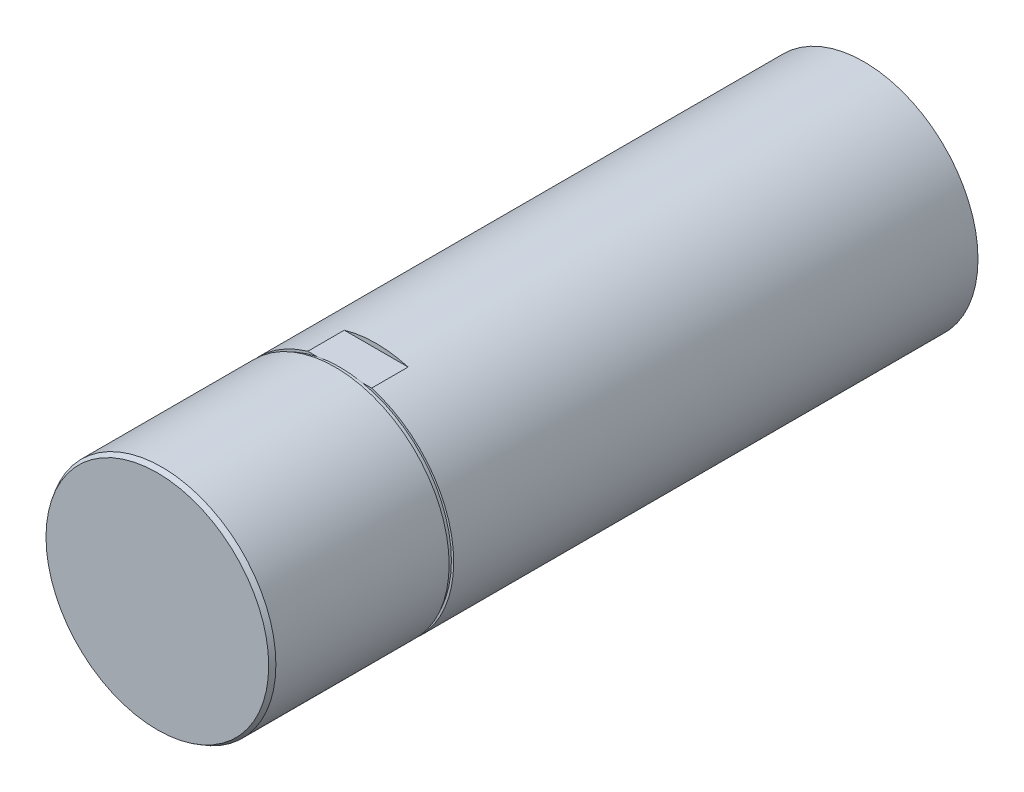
ISO-10303-21;
HEADER;
FILE_DESCRIPTION(('STEP AP214'),'2;1');
FILE_NAME('part.step','',(''),(''),'','','');
FILE_SCHEMA(('AUTOMOTIVE_DESIGN { 1 0 10303 214 1 1 1 1 }'));
ENDSEC;
DATA;
#1=APPLICATION_CONTEXT('core data for automotive mechanical design processes');
#2=APPLICATION_PROTOCOL_DEFINITION('international standard','automotive_design',2000,#1);
#3=PRODUCT_CONTEXT('',#1,'mechanical');
#4=PRODUCT('Part','Part','',(#3));
#5=PRODUCT_RELATED_PRODUCT_CATEGORY('part','',(#4));
#6=PRODUCT_DEFINITION_FORMATION('','',#4);
#7=PRODUCT_DEFINITION_CONTEXT('part definition',#1,'design');
#8=PRODUCT_DEFINITION('design','',#6,#7);
#9=PRODUCT_DEFINITION_SHAPE('','',#8);
#10=(LENGTH_UNIT() NAMED_UNIT(*) SI_UNIT(.MILLI.,.METRE.));
#11=(NAMED_UNIT(*) PLANE_ANGLE_UNIT() SI_UNIT($,.RADIAN.));
#12=(NAMED_UNIT(*) SI_UNIT($,.STERADIAN.) SOLID_ANGLE_UNIT());
#13=UNCERTAINTY_MEASURE_WITH_UNIT(LENGTH_MEASURE(1.E-05),#10,'distance_accuracy_value','');
#14=(GEOMETRIC_REPRESENTATION_CONTEXT(3) GLOBAL_UNCERTAINTY_ASSIGNED_CONTEXT((#13)) GLOBAL_UNIT_ASSIGNED_CONTEXT((#10,
#11,#12)) REPRESENTATION_CONTEXT('',''));
#15=CARTESIAN_POINT('',(0.,0.,0.));
#16=DIRECTION('',(0.,0.,1.));
#17=DIRECTION('',(1.,0.,0.));
#18=AXIS2_PLACEMENT_3D('',#15,#16,#17);
#19=CARTESIAN_POINT('',(0.,0.,15.));
#20=DIRECTION('',(0.,0.,1.));
#21=DIRECTION('',(1.,0.,0.));
#22=AXIS2_PLACEMENT_3D('',#19,#20,#21);
#23=PLANE('',#22);
#24=DIRECTION('',(1.,0.,0.));
#25=VECTOR('',#24,1.);
#26=CARTESIAN_POINT('',(-10.5,-24.,15.));
#27=LINE('',#26,#25);
#28=CARTESIAN_POINT('',(4.92442890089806,-24.,15.));
#29=VERTEX_POINT('',#28);
#30=CARTESIAN_POINT('',(7.00000000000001,-24.,15.));
#31=VERTEX_POINT('',#30);
#32=EDGE_CURVE('E98',#29,#31,#27,.T.);
#33=ORIENTED_EDGE('',*,*,#32,.T.);
#34=CARTESIAN_POINT('',(0.,0.,15.));
#35=DIRECTION('',(0.,0.,1.));
#36=DIRECTION('',(1.,0.,0.));
#37=AXIS2_PLACEMENT_3D('',#34,#35,#36);
#38=CIRCLE('',#37,25.);
#39=CARTESIAN_POINT('',(7.00000000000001,24.,15.));
#40=VERTEX_POINT('',#39);
#41=EDGE_CURVE('E112',#31,#40,#38,.T.);
#42=ORIENTED_EDGE('',*,*,#41,.T.);
#43=DIRECTION('',(1.,0.,0.));
#44=VECTOR('',#43,1.);
#45=CARTESIAN_POINT('',(-10.5,24.,15.));
#46=LINE('',#45,#44);
#47=CARTESIAN_POINT('',(4.92442890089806,24.,15.));
#48=VERTEX_POINT('',#47);
#49=EDGE_CURVE('E146',#48,#40,#46,.T.);
#50=ORIENTED_EDGE('',*,*,#49,.F.);
#51=CARTESIAN_POINT('',(0.,0.,15.));
#52=DIRECTION('',(0.,0.,1.));
#53=DIRECTION('',(1.,0.,0.));
#54=AXIS2_PLACEMENT_3D('',#51,#52,#53);
#55=CIRCLE('',#54,24.5);
#56=EDGE_CURVE('E140',#29,#48,#55,.T.);
#57=ORIENTED_EDGE('',*,*,#56,.F.);
#58=EDGE_LOOP('',(#33,#42,#50,#57));
#59=FACE_BOUND('',#58,.T.);
#60=ADVANCED_FACE('F35',(#59),#23,.T.);
#61=CARTESIAN_POINT('',(0.,0.,-100.));
#62=DIRECTION('',(0.,0.,1.));
#63=DIRECTION('',(1.,0.,0.));
#64=AXIS2_PLACEMENT_3D('',#61,#62,#63);
#65=CYLINDRICAL_SURFACE('',#64,25.);
#66=CARTESIAN_POINT('',(0.,0.,16.));
#67=DIRECTION('',(0.,0.,1.));
#68=DIRECTION('',(1.,0.,0.));
#69=AXIS2_PLACEMENT_3D('',#66,#67,#68);
#70=CIRCLE('',#69,25.);
#71=CARTESIAN_POINT('',(25.,0.,16.));
#72=VERTEX_POINT('',#71);
#73=EDGE_CURVE('E111',#72,#72,#70,.T.);
#74=ORIENTED_EDGE('',*,*,#73,.T.);
#75=EDGE_LOOP('',(#74));
#76=FACE_BOUND('',#75,.T.);
#77=CARTESIAN_POINT('',(0.,0.,53.9999999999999));
#78=DIRECTION('',(0.,0.,1.));
#79=DIRECTION('',(1.,0.,0.));
#80=AXIS2_PLACEMENT_3D('',#77,#78,#79);
#81=CIRCLE('',#80,25.);
#82=CARTESIAN_POINT('',(25.,0.,53.9999999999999));
#83=VERTEX_POINT('',#82);
#84=EDGE_CURVE('E125',#83,#83,#81,.F.);
#85=ORIENTED_EDGE('',*,*,#84,.T.);
#86=EDGE_LOOP('',(#85));
#87=FACE_BOUND('',#86,.T.);
#88=ADVANCED_FACE('F176',(#76,#87),#65,.T.);
#89=CARTESIAN_POINT('',(0.,0.,55.));
#90=DIRECTION('',(0.,0.,1.));
#91=DIRECTION('',(1.,0.,0.));
#92=AXIS2_PLACEMENT_3D('',#89,#90,#91);
#93=PLANE('',#92);
#94=CARTESIAN_POINT('',(0.,0.,55.));
#95=DIRECTION('',(0.,0.,1.));
#96=DIRECTION('',(1.,0.,0.));
#97=AXIS2_PLACEMENT_3D('',#94,#95,#96);
#98=CIRCLE('',#97,24.4226497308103);
#99=CARTESIAN_POINT('',(24.4226497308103,0.,55.));
#100=VERTEX_POINT('',#99);
#101=EDGE_CURVE('E122',#100,#100,#98,.T.);
#102=ORIENTED_EDGE('',*,*,#101,.T.);
#103=EDGE_LOOP('',(#102));
#104=FACE_BOUND('',#103,.T.);
#105=ADVANCED_FACE('F181',(#104),#93,.T.);
#106=CARTESIAN_POINT('',(0.,0.,55.));
#107=DIRECTION('',(0.,0.,-1.));
#108=DIRECTION('',(-1.,0.,0.));
#109=AXIS2_PLACEMENT_3D('',#106,#107,#108);
#110=CONICAL_SURFACE('',#109,24.4226497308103,0.523598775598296);
#111=ORIENTED_EDGE('',*,*,#84,.F.);
#112=EDGE_LOOP('',(#111));
#113=FACE_BOUND('',#112,.T.);
#114=ORIENTED_EDGE('',*,*,#101,.F.);
#115=EDGE_LOOP('',(#114));
#116=FACE_BOUND('',#115,.T.);
#117=ADVANCED_FACE('F37',(#113,#116),#110,.T.);
#118=CARTESIAN_POINT('',(0.,0.,16.));
#119=DIRECTION('',(0.,0.,1.));
#120=DIRECTION('',(1.,0.,0.));
#121=AXIS2_PLACEMENT_3D('',#118,#119,#120);
#122=PLANE('',#121);
#123=ORIENTED_EDGE('',*,*,#73,.F.);
#124=EDGE_LOOP('',(#123));
#125=FACE_BOUND('',#124,.T.);
#126=CARTESIAN_POINT('',(0.,0.,16.));
#127=DIRECTION('',(0.,0.,1.));
#128=DIRECTION('',(1.,0.,0.));
#129=AXIS2_PLACEMENT_3D('',#126,#127,#128);
#130=CIRCLE('',#129,24.5);
#131=CARTESIAN_POINT('',(24.5,0.,16.));
#132=VERTEX_POINT('',#131);
#133=EDGE_CURVE('E117',#132,#132,#130,.T.);
#134=ORIENTED_EDGE('',*,*,#133,.T.);
#135=EDGE_LOOP('',(#134));
#136=FACE_BOUND('',#135,.T.);
#137=ADVANCED_FACE('F186',(#125,#136),#122,.F.);
#138=CARTESIAN_POINT('',(-7.00000000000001,-24.,15.));
#139=VERTEX_POINT('',#138);
#140=CARTESIAN_POINT('',(-4.92442890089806,-24.,15.));
#141=VERTEX_POINT('',#140);
#142=EDGE_CURVE('E87',#139,#141,#27,.T.);
#143=ORIENTED_EDGE('',*,*,#142,.T.);
#144=CARTESIAN_POINT('',(-4.92442890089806,24.,15.));
#145=VERTEX_POINT('',#144);
#146=EDGE_CURVE('E150',#145,#141,#55,.T.);
#147=ORIENTED_EDGE('',*,*,#146,.F.);
#148=CARTESIAN_POINT('',(-7.00000000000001,24.,15.));
#149=VERTEX_POINT('',#148);
#150=EDGE_CURVE('E110',#149,#145,#46,.T.);
#151=ORIENTED_EDGE('',*,*,#150,.F.);
#152=EDGE_CURVE('E104',#149,#139,#38,.T.);
#153=ORIENTED_EDGE('',*,*,#152,.T.);
#154=EDGE_LOOP('',(#143,#147,#151,#153));
#155=FACE_BOUND('',#154,.T.);
#156=ADVANCED_FACE('F108',(#155),#23,.T.);
#157=CARTESIAN_POINT('',(0.,0.,16.));
#158=DIRECTION('',(0.,0.,-1.));
#159=DIRECTION('',(-1.,0.,0.));
#160=AXIS2_PLACEMENT_3D('',#157,#158,#159);
#161=CYLINDRICAL_SURFACE('',#160,24.5);
#162=ORIENTED_EDGE('',*,*,#133,.F.);
#163=EDGE_LOOP('',(#162));
#164=FACE_BOUND('',#163,.T.);
#165=EDGE_CURVE('E151',#48,#145,#55,.T.);
#166=ORIENTED_EDGE('',*,*,#165,.T.);
#167=ORIENTED_EDGE('',*,*,#146,.T.);
#168=CARTESIAN_POINT('',(0.,0.,15.));
#169=DIRECTION('',(0.,0.,1.));
#170=DIRECTION('',(1.,0.,0.));
#171=AXIS2_PLACEMENT_3D('',#168,#169,#170);
#172=CIRCLE('',#171,24.5);
#173=EDGE_CURVE('E155',#141,#29,#172,.T.);
#174=ORIENTED_EDGE('',*,*,#173,.T.);
#175=ORIENTED_EDGE('',*,*,#56,.T.);
#176=EDGE_LOOP('',(#166,#167,#174,#175));
#177=FACE_BOUND('',#176,.T.);
#178=ADVANCED_FACE('F161',(#164,#177),#161,.T.);
#179=CARTESIAN_POINT('',(0.,0.,-100.));
#180=DIRECTION('',(0.,0.,1.));
#181=DIRECTION('',(1.,0.,0.));
#182=AXIS2_PLACEMENT_3D('',#179,#180,#181);
#183=PLANE('',#182);
#184=CARTESIAN_POINT('',(0.,0.,-100.));
#185=DIRECTION('',(0.,0.,1.));
#186=DIRECTION('',(1.,0.,0.));
#187=AXIS2_PLACEMENT_3D('',#184,#185,#186);
#188=CIRCLE('',#187,25.);
#189=CARTESIAN_POINT('',(25.,0.,-100.));
#190=VERTEX_POINT('',#189);
#191=EDGE_CURVE('E115',#190,#190,#188,.T.);
#192=ORIENTED_EDGE('',*,*,#191,.F.);
#193=EDGE_LOOP('',(#192));
#194=FACE_BOUND('',#193,.T.);
#195=ADVANCED_FACE('F191',(#194),#183,.F.);
#196=DIRECTION('',(0.,0.,1.));
#197=VECTOR('',#196,1.);
#198=CARTESIAN_POINT('',(-7.00000000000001,-24.,-100.));
#199=LINE('',#198,#197);
#200=CARTESIAN_POINT('',(-7.00000000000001,-24.,7.00000000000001));
#201=VERTEX_POINT('',#200);
#202=EDGE_CURVE('E11',#139,#201,#199,.F.);
#203=ORIENTED_EDGE('',*,*,#202,.F.);
#204=ORIENTED_EDGE('',*,*,#152,.F.);
#205=DIRECTION('',(0.,0.,1.));
#206=VECTOR('',#205,1.);
#207=CARTESIAN_POINT('',(-7.00000000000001,24.,-100.));
#208=LINE('',#207,#206);
#209=CARTESIAN_POINT('',(-7.00000000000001,24.,7.00000000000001));
#210=VERTEX_POINT('',#209);
#211=EDGE_CURVE('E128',#210,#149,#208,.T.);
#212=ORIENTED_EDGE('',*,*,#211,.F.);
#213=CARTESIAN_POINT('',(0.,0.,7.00000000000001));
#214=DIRECTION('',(0.,0.,-1.));
#215=DIRECTION('',(-1.,0.,0.));
#216=AXIS2_PLACEMENT_3D('',#213,#214,#215);
#217=CIRCLE('',#216,25.);
#218=CARTESIAN_POINT('',(7.00000000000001,24.,7.00000000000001));
#219=VERTEX_POINT('',#218);
#220=EDGE_CURVE('E130',#219,#210,#217,.F.);
#221=ORIENTED_EDGE('',*,*,#220,.F.);
#222=DIRECTION('',(0.,0.,1.));
#223=VECTOR('',#222,1.);
#224=CARTESIAN_POINT('',(7.00000000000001,24.,-100.));
#225=LINE('',#224,#223);
#226=EDGE_CURVE('E132',#40,#219,#225,.F.);
#227=ORIENTED_EDGE('',*,*,#226,.F.);
#228=ORIENTED_EDGE('',*,*,#41,.F.);
#229=DIRECTION('',(0.,0.,1.));
#230=VECTOR('',#229,1.);
#231=CARTESIAN_POINT('',(7.00000000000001,-24.,-100.));
#232=LINE('',#231,#230);
#233=CARTESIAN_POINT('',(7.00000000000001,-24.,7.00000000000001));
#234=VERTEX_POINT('',#233);
#235=EDGE_CURVE('E43',#234,#31,#232,.T.);
#236=ORIENTED_EDGE('',*,*,#235,.F.);
#237=CARTESIAN_POINT('',(0.,0.,7.00000000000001));
#238=DIRECTION('',(0.,0.,-1.));
#239=DIRECTION('',(-1.,0.,0.));
#240=AXIS2_PLACEMENT_3D('',#237,#238,#239);
#241=CIRCLE('',#240,25.);
#242=EDGE_CURVE('E106',#201,#234,#241,.F.);
#243=ORIENTED_EDGE('',*,*,#242,.F.);
#244=EDGE_LOOP('',(#203,#204,#212,#221,#227,#228,#236,#243));
#245=FACE_BOUND('',#244,.T.);
#246=ORIENTED_EDGE('',*,*,#191,.T.);
#247=EDGE_LOOP('',(#246));
#248=FACE_BOUND('',#247,.T.);
#249=ADVANCED_FACE('F101',(#245,#248),#65,.T.);
#250=CARTESIAN_POINT('',(-10.5,25.5,15.));
#251=DIRECTION('',(0.,0.,1.));
#252=DIRECTION('',(1.,0.,0.));
#253=AXIS2_PLACEMENT_3D('',#250,#251,#252);
#254=PLANE('',#253);
#255=EDGE_CURVE('E152',#145,#48,#46,.T.);
#256=ORIENTED_EDGE('',*,*,#255,.F.);
#257=ORIENTED_EDGE('',*,*,#165,.F.);
#258=EDGE_LOOP('',(#256,#257));
#259=FACE_BOUND('',#258,.T.);
#260=ADVANCED_FACE('F202',(#259),#254,.F.);
#261=CARTESIAN_POINT('',(-10.5,25.5,7.00000000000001));
#262=DIRECTION('',(0.,0.,-1.));
#263=DIRECTION('',(-1.,0.,0.));
#264=AXIS2_PLACEMENT_3D('',#261,#262,#263);
#265=PLANE('',#264);
#266=ORIENTED_EDGE('',*,*,#220,.T.);
#267=DIRECTION('',(1.,0.,0.));
#268=VECTOR('',#267,1.);
#269=CARTESIAN_POINT('',(-10.5,24.,7.00000000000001));
#270=LINE('',#269,#268);
#271=EDGE_CURVE('E56',#210,#219,#270,.T.);
#272=ORIENTED_EDGE('',*,*,#271,.T.);
#273=EDGE_LOOP('',(#266,#272));
#274=FACE_BOUND('',#273,.T.);
#275=ADVANCED_FACE('F148',(#274),#265,.F.);
#276=CARTESIAN_POINT('',(-10.5,24.,15.));
#277=DIRECTION('',(0.,-1.,0.));
#278=DIRECTION('',(0.,0.,-1.));
#279=AXIS2_PLACEMENT_3D('',#276,#277,#278);
#280=PLANE('',#279);
#281=ORIENTED_EDGE('',*,*,#226,.T.);
#282=ORIENTED_EDGE('',*,*,#271,.F.);
#283=ORIENTED_EDGE('',*,*,#211,.T.);
#284=ORIENTED_EDGE('',*,*,#150,.T.);
#285=ORIENTED_EDGE('',*,*,#255,.T.);
#286=ORIENTED_EDGE('',*,*,#49,.T.);
#287=EDGE_LOOP('',(#281,#282,#283,#284,#285,#286));
#288=FACE_BOUND('',#287,.T.);
#289=ADVANCED_FACE('F144',(#288),#280,.F.);
#290=CARTESIAN_POINT('',(-10.5,-24.,15.));
#291=DIRECTION('',(0.,0.,1.));
#292=DIRECTION('',(1.,0.,0.));
#293=AXIS2_PLACEMENT_3D('',#290,#291,#292);
#294=PLANE('',#293);
#295=EDGE_CURVE('E92',#141,#29,#27,.T.);
#296=ORIENTED_EDGE('',*,*,#295,.T.);
#297=ORIENTED_EDGE('',*,*,#173,.F.);
#298=EDGE_LOOP('',(#296,#297));
#299=FACE_BOUND('',#298,.T.);
#300=ADVANCED_FACE('F164',(#299),#294,.F.);
#301=CARTESIAN_POINT('',(-10.5,-24.,15.));
#302=DIRECTION('',(0.,1.,0.));
#303=DIRECTION('',(0.,0.,1.));
#304=AXIS2_PLACEMENT_3D('',#301,#302,#303);
#305=PLANE('',#304);
#306=ORIENTED_EDGE('',*,*,#202,.T.);
#307=DIRECTION('',(1.,0.,0.));
#308=VECTOR('',#307,1.);
#309=CARTESIAN_POINT('',(-10.5,-24.,7.));
#310=LINE('',#309,#308);
#311=EDGE_CURVE('E49',#201,#234,#310,.T.);
#312=ORIENTED_EDGE('',*,*,#311,.T.);
#313=ORIENTED_EDGE('',*,*,#235,.T.);
#314=ORIENTED_EDGE('',*,*,#32,.F.);
#315=ORIENTED_EDGE('',*,*,#295,.F.);
#316=ORIENTED_EDGE('',*,*,#142,.F.);
#317=EDGE_LOOP('',(#306,#312,#313,#314,#315,#316));
#318=FACE_BOUND('',#317,.T.);
#319=ADVANCED_FACE('F89',(#318),#305,.F.);
#320=CARTESIAN_POINT('',(-10.5,-24.,7.));
#321=DIRECTION('',(0.,0.,-1.));
#322=DIRECTION('',(-1.,0.,0.));
#323=AXIS2_PLACEMENT_3D('',#320,#321,#322);
#324=PLANE('',#323);
#325=ORIENTED_EDGE('',*,*,#242,.T.);
#326=ORIENTED_EDGE('',*,*,#311,.F.);
#327=EDGE_LOOP('',(#325,#326));
#328=FACE_BOUND('',#327,.T.);
#329=ADVANCED_FACE('F171',(#328),#324,.F.);
#330=CLOSED_SHELL('',(#60,#88,#105,#117,#137,#156,#178,#195,#249,#260,#275,#289,#300,#319,#329));
#331=MANIFOLD_SOLID_BREP('B2',#330);
#332=ADVANCED_BREP_SHAPE_REPRESENTATION('',(#18,#331),#14);
#333=SHAPE_DEFINITION_REPRESENTATION(#9,#332);
ENDSEC;
END-ISO-10303-21;
